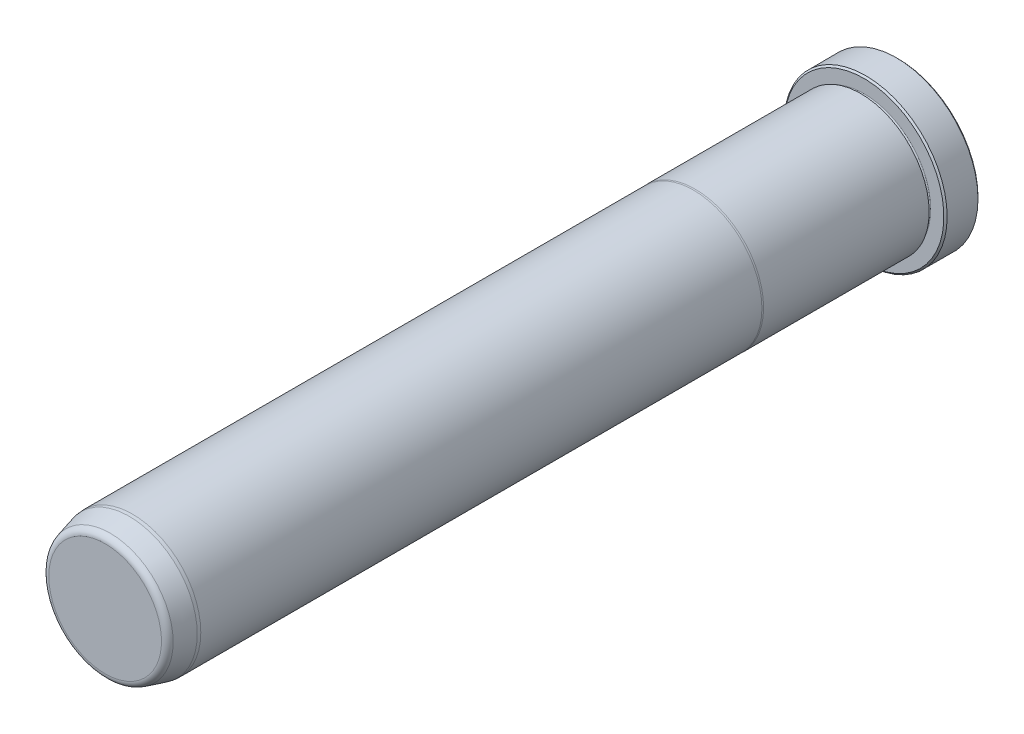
ISO-10303-21;
HEADER;
FILE_DESCRIPTION(('STEP AP214'),'2;1');
FILE_NAME('part.step','',(''),(''),'','','');
FILE_SCHEMA(('AUTOMOTIVE_DESIGN { 1 0 10303 214 1 1 1 1 }'));
ENDSEC;
DATA;
#1=APPLICATION_CONTEXT('core data for automotive mechanical design processes');
#2=APPLICATION_PROTOCOL_DEFINITION('international standard','automotive_design',2000,#1);
#3=PRODUCT_CONTEXT('',#1,'mechanical');
#4=PRODUCT('Part','Part','',(#3));
#5=PRODUCT_RELATED_PRODUCT_CATEGORY('part','',(#4));
#6=PRODUCT_DEFINITION_FORMATION('','',#4);
#7=PRODUCT_DEFINITION_CONTEXT('part definition',#1,'design');
#8=PRODUCT_DEFINITION('design','',#6,#7);
#9=PRODUCT_DEFINITION_SHAPE('','',#8);
#10=(LENGTH_UNIT() NAMED_UNIT(*) SI_UNIT(.MILLI.,.METRE.));
#11=(NAMED_UNIT(*) PLANE_ANGLE_UNIT() SI_UNIT($,.RADIAN.));
#12=(NAMED_UNIT(*) SI_UNIT($,.STERADIAN.) SOLID_ANGLE_UNIT());
#13=UNCERTAINTY_MEASURE_WITH_UNIT(LENGTH_MEASURE(1.E-05),#10,'distance_accuracy_value','');
#14=(GEOMETRIC_REPRESENTATION_CONTEXT(3) GLOBAL_UNCERTAINTY_ASSIGNED_CONTEXT((#13)) GLOBAL_UNIT_ASSIGNED_CONTEXT((#10,
#11,#12)) REPRESENTATION_CONTEXT('',''));
#15=CARTESIAN_POINT('',(0.,0.,0.));
#16=DIRECTION('',(0.,0.,1.));
#17=DIRECTION('',(1.,0.,0.));
#18=AXIS2_PLACEMENT_3D('',#15,#16,#17);
#19=CARTESIAN_POINT('',(0.,0.,0.));
#20=DIRECTION('',(0.,0.,1.));
#21=DIRECTION('',(1.,0.,0.));
#22=AXIS2_PLACEMENT_3D('',#19,#20,#21);
#23=PLANE('',#22);
#24=CARTESIAN_POINT('',(0.,0.,0.));
#25=DIRECTION('',(0.,0.,1.));
#26=DIRECTION('',(1.,0.,0.));
#27=AXIS2_PLACEMENT_3D('',#24,#25,#26);
#28=CIRCLE('',#27,18.542);
#29=CARTESIAN_POINT('',(18.542,0.,0.));
#30=VERTEX_POINT('',#29);
#31=EDGE_CURVE('E37',#30,#30,#28,.F.);
#32=ORIENTED_EDGE('',*,*,#31,.T.);
#33=EDGE_LOOP('',(#32));
#34=FACE_BOUND('',#33,.T.);
#35=ADVANCED_FACE('F30',(#34),#23,.F.);
#36=CARTESIAN_POINT('',(0.,0.,0.));
#37=DIRECTION('',(0.,0.,1.));
#38=DIRECTION('',(1.,0.,0.));
#39=AXIS2_PLACEMENT_3D('',#36,#37,#38);
#40=CYLINDRICAL_SURFACE('',#39,18.923);
#41=CARTESIAN_POINT('',(0.,0.,0.380999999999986));
#42=DIRECTION('',(0.,0.,1.));
#43=DIRECTION('',(1.,0.,0.));
#44=AXIS2_PLACEMENT_3D('',#41,#42,#43);
#45=CIRCLE('',#44,18.923);
#46=CARTESIAN_POINT('',(18.923,0.,0.380999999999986));
#47=VERTEX_POINT('',#46);
#48=EDGE_CURVE('E41',#47,#47,#45,.T.);
#49=ORIENTED_EDGE('',*,*,#48,.T.);
#50=EDGE_LOOP('',(#49));
#51=FACE_BOUND('',#50,.T.);
#52=CARTESIAN_POINT('',(0.,0.,7.54379999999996));
#53=DIRECTION('',(0.,0.,-1.));
#54=DIRECTION('',(-1.,0.,0.));
#55=AXIS2_PLACEMENT_3D('',#52,#53,#54);
#56=CIRCLE('',#55,18.923);
#57=CARTESIAN_POINT('',(-18.923,0.,7.54379999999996));
#58=VERTEX_POINT('',#57);
#59=EDGE_CURVE('E45',#58,#58,#56,.T.);
#60=ORIENTED_EDGE('',*,*,#59,.T.);
#61=EDGE_LOOP('',(#60));
#62=FACE_BOUND('',#61,.T.);
#63=ADVANCED_FACE('F118',(#51,#62),#40,.T.);
#64=CARTESIAN_POINT('',(0.,18.923,7.9248));
#65=DIRECTION('',(0.,0.,-1.));
#66=DIRECTION('',(-1.,0.,0.));
#67=AXIS2_PLACEMENT_3D('',#64,#65,#66);
#68=PLANE('',#67);
#69=CARTESIAN_POINT('',(0.,0.,7.9248));
#70=DIRECTION('',(0.,0.,-1.));
#71=DIRECTION('',(-1.,0.,0.));
#72=AXIS2_PLACEMENT_3D('',#69,#70,#71);
#73=CIRCLE('',#72,18.5419999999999);
#74=CARTESIAN_POINT('',(-18.5419999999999,0.,7.9248));
#75=VERTEX_POINT('',#74);
#76=EDGE_CURVE('E10',#75,#75,#73,.F.);
#77=ORIENTED_EDGE('',*,*,#76,.T.);
#78=EDGE_LOOP('',(#77));
#79=FACE_BOUND('',#78,.T.);
#80=CARTESIAN_POINT('',(0.,0.,7.9248));
#81=DIRECTION('',(0.,0.,1.));
#82=DIRECTION('',(1.,0.,0.));
#83=AXIS2_PLACEMENT_3D('',#80,#81,#82);
#84=CIRCLE('',#83,15.4813);
#85=CARTESIAN_POINT('',(15.4813,0.,7.9248));
#86=VERTEX_POINT('',#85);
#87=EDGE_CURVE('E56',#86,#86,#84,.T.);
#88=ORIENTED_EDGE('',*,*,#87,.F.);
#89=EDGE_LOOP('',(#88));
#90=FACE_BOUND('',#89,.T.);
#91=ADVANCED_FACE('F113',(#79,#90),#68,.F.);
#92=CARTESIAN_POINT('',(0.,0.,8.3058));
#93=DIRECTION('',(0.,0.,1.));
#94=DIRECTION('',(1.,0.,0.));
#95=AXIS2_PLACEMENT_3D('',#92,#93,#94);
#96=TOROIDAL_SURFACE('',#95,15.4813,0.381000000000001);
#97=CARTESIAN_POINT('',(0.,0.,8.6868));
#98=DIRECTION('',(0.,0.,1.));
#99=DIRECTION('',(1.,0.,0.));
#100=AXIS2_PLACEMENT_3D('',#97,#98,#99);
#101=CIRCLE('',#100,15.4813);
#102=CARTESIAN_POINT('',(15.4813,0.,8.6868));
#103=VERTEX_POINT('',#102);
#104=EDGE_CURVE('E59',#103,#103,#101,.T.);
#105=ORIENTED_EDGE('',*,*,#104,.F.);
#106=EDGE_LOOP('',(#105));
#107=FACE_BOUND('',#106,.T.);
#108=ORIENTED_EDGE('',*,*,#87,.T.);
#109=EDGE_LOOP('',(#108));
#110=FACE_BOUND('',#109,.T.);
#111=ADVANCED_FACE('F107',(#107,#110),#96,.F.);
#112=CARTESIAN_POINT('',(0.,15.4813,8.6868));
#113=DIRECTION('',(0.,0.,1.));
#114=DIRECTION('',(1.,0.,0.));
#115=AXIS2_PLACEMENT_3D('',#112,#113,#114);
#116=PLANE('',#115);
#117=CARTESIAN_POINT('',(0.,0.,8.6868));
#118=DIRECTION('',(0.,0.,1.));
#119=DIRECTION('',(1.,0.,0.));
#120=AXIS2_PLACEMENT_3D('',#117,#118,#119);
#121=CIRCLE('',#120,15.8877);
#122=CARTESIAN_POINT('',(15.8877,0.,8.6868));
#123=VERTEX_POINT('',#122);
#124=EDGE_CURVE('E62',#123,#123,#121,.T.);
#125=ORIENTED_EDGE('',*,*,#124,.F.);
#126=EDGE_LOOP('',(#125));
#127=FACE_BOUND('',#126,.T.);
#128=ORIENTED_EDGE('',*,*,#104,.T.);
#129=EDGE_LOOP('',(#128));
#130=FACE_BOUND('',#129,.T.);
#131=ADVANCED_FACE('F101',(#127,#130),#116,.F.);
#132=CARTESIAN_POINT('',(0.,0.,0.));
#133=DIRECTION('',(0.,0.,1.));
#134=DIRECTION('',(1.,0.,0.));
#135=AXIS2_PLACEMENT_3D('',#132,#133,#134);
#136=CYLINDRICAL_SURFACE('',#135,15.8877);
#137=CARTESIAN_POINT('',(0.,0.,47.1347630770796));
#138=DIRECTION('',(0.,0.,1.));
#139=DIRECTION('',(1.,0.,0.));
#140=AXIS2_PLACEMENT_3D('',#137,#138,#139);
#141=CIRCLE('',#140,15.8877);
#142=CARTESIAN_POINT('',(15.8877,0.,47.1347630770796));
#143=VERTEX_POINT('',#142);
#144=EDGE_CURVE('E65',#143,#143,#141,.T.);
#145=ORIENTED_EDGE('',*,*,#144,.F.);
#146=EDGE_LOOP('',(#145));
#147=FACE_BOUND('',#146,.T.);
#148=ORIENTED_EDGE('',*,*,#124,.T.);
#149=EDGE_LOOP('',(#148));
#150=FACE_BOUND('',#149,.T.);
#151=ADVANCED_FACE('F95',(#147,#150),#136,.T.);
#152=CARTESIAN_POINT('',(0.,0.,47.1347630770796));
#153=DIRECTION('',(0.,0.,-1.));
#154=DIRECTION('',(-1.,0.,0.));
#155=AXIS2_PLACEMENT_3D('',#152,#153,#154);
#156=CONICAL_SURFACE('',#155,15.8877,0.0698131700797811);
#157=CARTESIAN_POINT('',(0.,0.,47.498));
#158=DIRECTION('',(0.,0.,1.));
#159=DIRECTION('',(1.,0.,0.));
#160=AXIS2_PLACEMENT_3D('',#157,#158,#159);
#161=CIRCLE('',#160,15.8623);
#162=CARTESIAN_POINT('',(15.8623,0.,47.498));
#163=VERTEX_POINT('',#162);
#164=EDGE_CURVE('E68',#163,#163,#161,.T.);
#165=ORIENTED_EDGE('',*,*,#164,.F.);
#166=EDGE_LOOP('',(#165));
#167=FACE_BOUND('',#166,.T.);
#168=ORIENTED_EDGE('',*,*,#144,.T.);
#169=EDGE_LOOP('',(#168));
#170=FACE_BOUND('',#169,.T.);
#171=ADVANCED_FACE('F89',(#167,#170),#156,.T.);
#172=CARTESIAN_POINT('',(0.,0.,0.));
#173=DIRECTION('',(0.,0.,1.));
#174=DIRECTION('',(1.,0.,0.));
#175=AXIS2_PLACEMENT_3D('',#172,#173,#174);
#176=CYLINDRICAL_SURFACE('',#175,15.8623);
#177=CARTESIAN_POINT('',(0.,0.,177.8));
#178=DIRECTION('',(0.,0.,1.));
#179=DIRECTION('',(1.,0.,0.));
#180=AXIS2_PLACEMENT_3D('',#177,#178,#179);
#181=CIRCLE('',#180,15.8623);
#182=CARTESIAN_POINT('',(15.8623,0.,177.8));
#183=VERTEX_POINT('',#182);
#184=EDGE_CURVE('E71',#183,#183,#181,.T.);
#185=ORIENTED_EDGE('',*,*,#184,.F.);
#186=EDGE_LOOP('',(#185));
#187=FACE_BOUND('',#186,.T.);
#188=ORIENTED_EDGE('',*,*,#164,.T.);
#189=EDGE_LOOP('',(#188));
#190=FACE_BOUND('',#189,.T.);
#191=ADVANCED_FACE('F83',(#187,#190),#176,.T.);
#192=CARTESIAN_POINT('',(0.,0.,177.8));
#193=DIRECTION('',(0.,0.,-1.));
#194=DIRECTION('',(-1.,0.,0.));
#195=AXIS2_PLACEMENT_3D('',#192,#193,#194);
#196=CONICAL_SURFACE('',#195,15.8623,0.0872664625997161);
#197=CARTESIAN_POINT('',(0.,0.,178.562));
#198=DIRECTION('',(0.,0.,1.));
#199=DIRECTION('',(1.,0.,0.));
#200=AXIS2_PLACEMENT_3D('',#197,#198,#199);
#201=CIRCLE('',#200,15.7956336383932);
#202=CARTESIAN_POINT('',(15.7956336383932,0.,178.562));
#203=VERTEX_POINT('',#202);
#204=EDGE_CURVE('E74',#203,#203,#201,.T.);
#205=ORIENTED_EDGE('',*,*,#204,.F.);
#206=EDGE_LOOP('',(#205));
#207=FACE_BOUND('',#206,.T.);
#208=ORIENTED_EDGE('',*,*,#184,.T.);
#209=EDGE_LOOP('',(#208));
#210=FACE_BOUND('',#209,.T.);
#211=ADVANCED_FACE('F80',(#207,#210),#196,.T.);
#212=CARTESIAN_POINT('',(0.,0.,178.562));
#213=DIRECTION('',(0.,0.,-1.));
#214=DIRECTION('',(-1.,0.,0.));
#215=AXIS2_PLACEMENT_3D('',#212,#213,#214);
#216=CONICAL_SURFACE('',#215,15.7956336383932,0.261799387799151);
#217=CARTESIAN_POINT('',(0.,0.,182.9733752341));
#218=DIRECTION('',(0.,0.,1.));
#219=DIRECTION('',(1.,0.,0.));
#220=AXIS2_PLACEMENT_3D('',#217,#218,#219);
#221=CIRCLE('',#220,14.6136092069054);
#222=CARTESIAN_POINT('',(14.6136092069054,0.,182.9733752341));
#223=VERTEX_POINT('',#222);
#224=EDGE_CURVE('E50',#223,#223,#221,.F.);
#225=ORIENTED_EDGE('',*,*,#224,.T.);
#226=EDGE_LOOP('',(#225));
#227=FACE_BOUND('',#226,.T.);
#228=ORIENTED_EDGE('',*,*,#204,.T.);
#229=EDGE_LOOP('',(#228));
#230=FACE_BOUND('',#229,.T.);
#231=ADVANCED_FACE('F78',(#227,#230),#216,.T.);
#232=CARTESIAN_POINT('',(0.,14.2983335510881,184.15));
#233=DIRECTION('',(0.,0.,-1.));
#234=DIRECTION('',(-1.,0.,0.));
#235=AXIS2_PLACEMENT_3D('',#232,#233,#234);
#236=PLANE('',#235);
#237=CARTESIAN_POINT('',(0.,0.,184.15));
#238=DIRECTION('',(0.,0.,-1.));
#239=DIRECTION('',(-1.,0.,0.));
#240=AXIS2_PLACEMENT_3D('',#237,#238,#239);
#241=CIRCLE('',#240,13.0802019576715);
#242=CARTESIAN_POINT('',(-13.0802019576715,0.,184.15));
#243=VERTEX_POINT('',#242);
#244=EDGE_CURVE('E53',#243,#243,#241,.F.);
#245=ORIENTED_EDGE('',*,*,#244,.T.);
#246=EDGE_LOOP('',(#245));
#247=FACE_BOUND('',#246,.T.);
#248=ADVANCED_FACE('F133',(#247),#236,.F.);
#249=CARTESIAN_POINT('',(0.,0.,182.5625));
#250=DIRECTION('',(0.,0.,-1.));
#251=DIRECTION('',(-1.,0.,0.));
#252=AXIS2_PLACEMENT_3D('',#249,#250,#251);
#253=TOROIDAL_SURFACE('',#252,13.0802019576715,1.5875);
#254=ORIENTED_EDGE('',*,*,#224,.F.);
#255=EDGE_LOOP('',(#254));
#256=FACE_BOUND('',#255,.T.);
#257=ORIENTED_EDGE('',*,*,#244,.F.);
#258=EDGE_LOOP('',(#257));
#259=FACE_BOUND('',#258,.T.);
#260=ADVANCED_FACE('F130',(#256,#259),#253,.T.);
#261=CARTESIAN_POINT('',(0.,0.,0.380999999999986));
#262=DIRECTION('',(0.,0.,1.));
#263=DIRECTION('',(1.,0.,0.));
#264=AXIS2_PLACEMENT_3D('',#261,#262,#263);
#265=CONICAL_SURFACE('',#264,18.923,0.785398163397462);
#266=ORIENTED_EDGE('',*,*,#31,.F.);
#267=EDGE_LOOP('',(#266));
#268=FACE_BOUND('',#267,.T.);
#269=ORIENTED_EDGE('',*,*,#48,.F.);
#270=EDGE_LOOP('',(#269));
#271=FACE_BOUND('',#270,.T.);
#272=ADVANCED_FACE('F132',(#268,#271),#265,.T.);
#273=CARTESIAN_POINT('',(0.,0.,7.9248));
#274=DIRECTION('',(0.,0.,-1.));
#275=DIRECTION('',(-1.,0.,0.));
#276=AXIS2_PLACEMENT_3D('',#273,#274,#275);
#277=CONICAL_SURFACE('',#276,18.5419999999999,0.785398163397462);
#278=ORIENTED_EDGE('',*,*,#59,.F.);
#279=EDGE_LOOP('',(#278));
#280=FACE_BOUND('',#279,.T.);
#281=ORIENTED_EDGE('',*,*,#76,.F.);
#282=EDGE_LOOP('',(#281));
#283=FACE_BOUND('',#282,.T.);
#284=ADVANCED_FACE('F32',(#280,#283),#277,.T.);
#285=CLOSED_SHELL('',(#35,#63,#91,#111,#131,#151,#171,#191,#211,#231,#248,#260,#272,#284));
#286=MANIFOLD_SOLID_BREP('B2',#285);
#287=ADVANCED_BREP_SHAPE_REPRESENTATION('',(#18,#286),#14);
#288=SHAPE_DEFINITION_REPRESENTATION(#9,#287);
ENDSEC;
END-ISO-10303-21;
